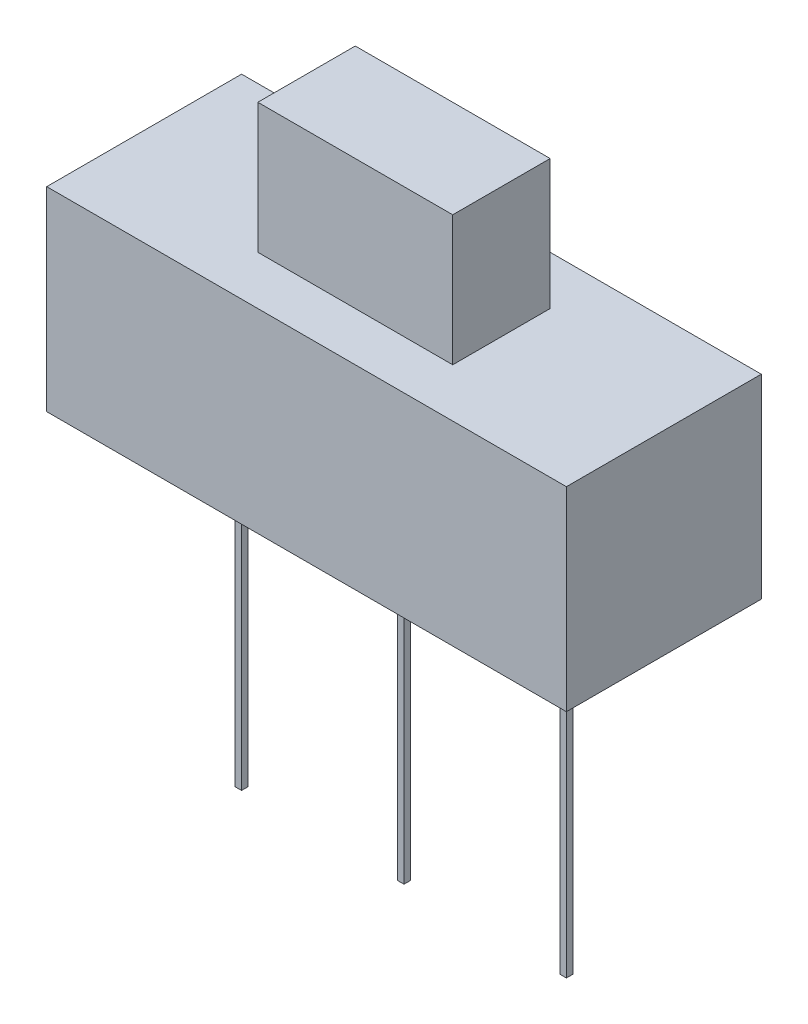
from build123d import *

# Parameters (mm, degrees)
SKETCH1_W           = 8
SKETCH1_H           = 3
BOSS_EXTRUDE1_DEPTH = 3
SKETCH2_W           = 3
SKETCH2_H           = 1.5
BOSS_EXTRUDE2_DEPTH = 2
SKETCH3_W           = 0.1
SKETCH3_H           = 0.1
BOSS_EXTRUDE3_DEPTH = 5


with BuildPart() as part:
    # Sketch1 → Boss-Extrude1 (new body)
    with BuildSketch(Plane(origin=(0, 0, 0), x_dir=(1, 0, 0), z_dir=(0, 1, 0))):
        Rectangle(SKETCH1_W, SKETCH1_H)
    extrude(amount=BOSS_EXTRUDE1_DEPTH)

    # Sketch2 → Boss-Extrude2 (add)
    with BuildSketch(Plane(origin=(0, 3, 0), x_dir=(1, 0, 0), z_dir=(0, 1, 0))):
        Rectangle(SKETCH2_W, SKETCH2_H)
    extrude(amount=BOSS_EXTRUDE2_DEPTH)

    # Sketch3 → Boss-Extrude3 (add)
    with BuildSketch(Plane.XZ):
        with Locations((2.5, 0)):
            Rectangle(SKETCH3_W, SKETCH3_H)
        Rectangle(SKETCH3_W, SKETCH3_H)
        with Locations((-2.5, 0)):
            Rectangle(SKETCH3_W, SKETCH3_H)
    extrude(amount=BOSS_EXTRUDE3_DEPTH)


solid = part.part
